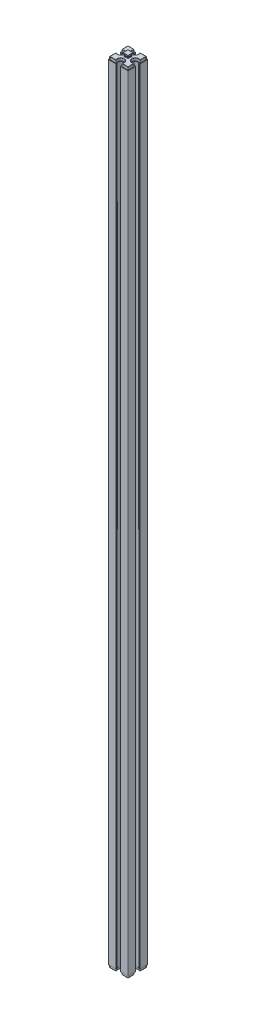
from build123d import *

# Parameters (mm, degrees)
EXTRUDE_1_DEPTH        = 298
EXTRUDE_2_DEPTH        = 2
EXTRUDE_3_DEPTH        = 2
FILLET_3_R             = 0.2
CUT_EXTRUDE_1_DEPTH    = 3
FILLET_4_R             = 0.2
FILLET_5_R             = 0.1
FILLET_3_OF_MIRROR_1_R = 0.2
FILLET_4_OF_MIRROR_1_R = 0.2
FILLET_5_OF_MIRROR_1_R = 0.1


with BuildPart() as part:
    # Sketch 1 → Extrude 1 (new body)
    with BuildSketch(Plane(origin=(0, 0, 0), x_dir=(1, 0, 0), z_dir=(0, 1, 0))):
        with BuildLine():
            Line((-7.5, 7.5), (-1.5, 7.5))
            Line((-1.5, 7.5), (-1.5, 6.822875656))
            ThreePointArc((-1.5, 6.822875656), (0, 3.5), (1.5, 6.822875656))
            Line((1.5, 6.822875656), (1.5, 7.5))
            Line((1.5, 7.5), (7.5, 7.5))
            Line((7.5, 7.5), (7.5, 1.5))
            Line((7.5, 1.5), (6.822875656, 1.5))
            ThreePointArc((6.822875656, 1.5), (3.5, 0), (6.822875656, -1.5))
            Line((6.822875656, -1.5), (7.5, -1.5))
            Line((7.5, -1.5), (7.5, -7.5))
            Line((7.5, -7.5), (1.5, -7.5))
            Line((1.5, -7.5), (1.5, -6.822875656))
            ThreePointArc((1.5, -6.822875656), (0, -3.5), (-1.5, -6.822875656))
            Line((-1.5, -6.822875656), (-1.5, -7.5))
            Line((-1.5, -7.5), (-7.5, -7.5))
            Line((-7.5, -7.5), (-7.5, -1.5))
            Line((-7.5, -1.5), (-6.822875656, -1.5))
            ThreePointArc((-6.822875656, -1.5), (-3.5, 0), (-6.822875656, 1.5))
            Line((-6.822875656, 1.5), (-7.5, 1.5))
            Line((-7.5, 1.5), (-7.5, 7.5))
        make_face()
    extrude_1 = extrude(amount=EXTRUDE_1_DEPTH)

    # Sketch 2 → Extrude 2 (add)
    with BuildSketch(Plane(origin=(0, 298, 0), x_dir=(1, 0, 0), z_dir=(0, 1, 0))):
        with BuildLine():
            Line((-7, 7), (-7, 2))
            ThreePointArc((-7, 2), (-3, 0), (-7, -2))
            Line((-7, -2), (-7, -7))
            Line((-7, -7), (-2, -7))
            ThreePointArc((-2, -7), (0, -3), (2, -7))
            Line((2, -7), (7, -7))
            Line((7, -7), (7, -2))
            ThreePointArc((7, -2), (3, 0), (7, 2))
            Line((7, 2), (7, 7))
            Line((7, 7), (2, 7))
            ThreePointArc((2, 7), (0, 3), (-2, 7))
            Line((-2, 7), (-7, 7))
        make_face()
    extrude_2 = extrude(amount=EXTRUDE_2_DEPTH)

    # Sketch 3 → Extrude 3 (add, symmetric)
    with BuildSketch(Plane(origin=(0, 0, 0), x_dir=(0, 0, -1), z_dir=(1, 0, 0))):
        with BuildLine():
            Line((-1.5, 300), (1.5, 300))
            Line((1.5, 300), (1.5, 300.677124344))
            ThreePointArc((1.5, 300.677124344), (1.780042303, 301.088161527), (1.95, 301.555590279))
            Line((1.95, 301.555590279), (1.95, 302.5))
            Line((1.95, 302.5), (-1.95, 302.5))
            Line((-1.95, 302.5), (-1.95, 301.555590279))
            ThreePointArc((-1.95, 301.555590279), (-1.780042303, 301.088161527), (-1.5, 300.677124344))
            Line((-1.5, 300.677124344), (-1.5, 300))
        make_face()
    extrude_3 = extrude(amount=EXTRUDE_3_DEPTH, both=True)

    # Fillet 3
    fillet_3_edges = [part.edges().sort_by_distance(p)[0] for p in [
        (-7.5, 149, -7.5),
        (-1.5, 149, -7.5),
        (1.5, 149, -7.5),
        (7.5, 149, -7.5),
        (7.5, 149, -1.5),
        (7.5, 149, 1.5),
        (7.5, 149, 7.5),
        (1.5, 149, 7.5),
        (-1.5, 149, 7.5),
        (-7.5, 149, 7.5),
        (-7.5, 149, 1.5),
        (-6.822875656, 149, -1.5),
        (-7.5, 149, -1.5),
    ]]
    fillet(fillet_3_edges, radius=FILLET_3_R)

    # Sketch 4 → Cut-Extrude 1 (cut, symmetric)
    with BuildSketch(Plane.XY):
        with BuildLine():
            Line((1.95, 302.5), (2, 302.5))
            Line((2, 302.5), (2, 300))
            Line((2, 300), (1.5, 300))
            Line((1.5, 300), (1.5, 300.677124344))
            ThreePointArc((1.5, 300.677124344), (1.780042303, 301.088161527), (1.95, 301.555590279))
            Line((1.95, 301.555590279), (1.95, 302.5))
        make_face()
        with BuildLine():
            Line((-1.95, 302.5), (-1.95, 301.555590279))
            ThreePointArc((-1.95, 301.555590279), (-1.780042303, 301.088161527), (-1.5, 300.677124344))
            Line((-1.5, 300.677124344), (-1.5, 300))
            Line((-1.5, 300), (-2, 300))
            Line((-2, 300), (-2, 302.5))
            Line((-2, 302.5), (-1.95, 302.5))
        make_face()
    cut_extrude_1 = extrude(amount=CUT_EXTRUDE_1_DEPTH, both=True, mode=Mode.SUBTRACT)

    # Fillet 4
    fillet_4_edges = [part.edges().sort_by_distance(p)[0] for p in [
        (-2, 299, -7),
        (-7, 299, -7),
        (-7, 299, -2),
        (-7, 299, 2),
        (-7, 299, 7),
        (-2, 299, 7),
        (2, 299, 7),
        (7, 299, 7),
        (7, 299, 2),
        (7, 299, -2),
        (7, 299, -7),
        (2, 299, -7),
        (-4.5, 300, -7),
        (-7, 300, -4.5),
        (-3, 300, 0),
        (-7, 300, 4.5),
        (-4.5, 300, 7),
        (0, 300, 3),
        (4.5, 300, 7),
        (7, 300, 4.5),
        (3, 300, 0),
        (7, 300, -4.5),
        (4.5, 300, -7),
        (0, 300, -3),
    ]]
    fillet(fillet_4_edges, radius=FILLET_4_R)

    # Fillet 5
    fillet_5_edges = [part.edges().sort_by_distance(p)[0] for p in [
        (1.95, 302.5, 0),
        (0, 302.5, -1.95),
        (0, 302.5, 1.95),
        (-1.95, 302.5, 0),
    ]]
    fillet(fillet_5_edges, radius=FILLET_5_R)


with BuildPart() as mirror_1_1:
    # Mirror 1: Extrude 1, Extrude 2, Extrude 3 across Top Plane
    add(extrude_1.mirror(Plane(origin=(0, 0, 0), x_dir=(1, 0, 0), z_dir=(0, 1, 0))))
    add(extrude_2.mirror(Plane(origin=(0, 0, 0), x_dir=(1, 0, 0), z_dir=(0, 1, 0))))
    add(extrude_3.mirror(Plane(origin=(0, 0, 0), x_dir=(1, 0, 0), z_dir=(0, 1, 0))))

    # Mirror 1 2: Cut-Extrude 1 across Top Plane
    add(cut_extrude_1.mirror(Plane(origin=(0, 0, 0), x_dir=(1, 0, 0), z_dir=(0, 1, 0))), mode=Mode.SUBTRACT)

    # Fillet 3 of Mirror 1
    fillet_3_of_mirror_1_edges = [mirror_1_1.edges().sort_by_distance(p)[0] for p in [
        (-7.5, -149, -7.5),
        (-1.5, -149, -7.5),
        (1.5, -149, -7.5),
        (7.5, -149, -7.5),
        (7.5, -149, -1.5),
        (7.5, -149, 1.5),
        (7.5, -149, 7.5),
        (1.5, -149, 7.5),
        (-1.5, -149, 7.5),
        (-7.5, -149, 7.5),
        (-7.5, -149, 1.5),
        (-6.822875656, -149, -1.5),
        (-7.5, -149, -1.5),
    ]]
    fillet(fillet_3_of_mirror_1_edges, radius=FILLET_3_OF_MIRROR_1_R)

    # Fillet 4 of Mirror 1
    fillet_4_of_mirror_1_edges = [mirror_1_1.edges().sort_by_distance(p)[0] for p in [
        (-2, -299, -7),
        (-7, -299, -7),
        (-7, -299, -2),
        (-7, -299, 2),
        (-7, -299, 7),
        (-2, -299, 7),
        (2, -299, 7),
        (7, -299, 7),
        (7, -299, 2),
        (7, -299, -2),
        (7, -299, -7),
        (2, -299, -7),
        (-4.5, -300, -7),
        (-7, -300, -4.5),
        (-3, -300, 0),
        (-7, -300, 4.5),
        (-4.5, -300, 7),
        (0, -300, 3),
        (4.5, -300, 7),
        (7, -300, 4.5),
        (3, -300, 0),
        (7, -300, -4.5),
        (4.5, -300, -7),
        (0, -300, -3),
    ]]
    fillet(fillet_4_of_mirror_1_edges, radius=FILLET_4_OF_MIRROR_1_R)

    # Fillet 5 of Mirror 1
    fillet_5_of_mirror_1_edges = [mirror_1_1.edges().sort_by_distance(p)[0] for p in [
        (1.95, -302.5, 0),
        (0, -302.5, -1.95),
        (0, -302.5, 1.95),
        (-1.95, -302.5, 0),
    ]]
    fillet(fillet_5_of_mirror_1_edges, radius=FILLET_5_OF_MIRROR_1_R)


with BuildPart() as part_1:
    add(part.part)

    # Mirror 1 united with what the copies tou: union Mirror 1_1
    add(mirror_1_1.part)


solid = part_1.part
